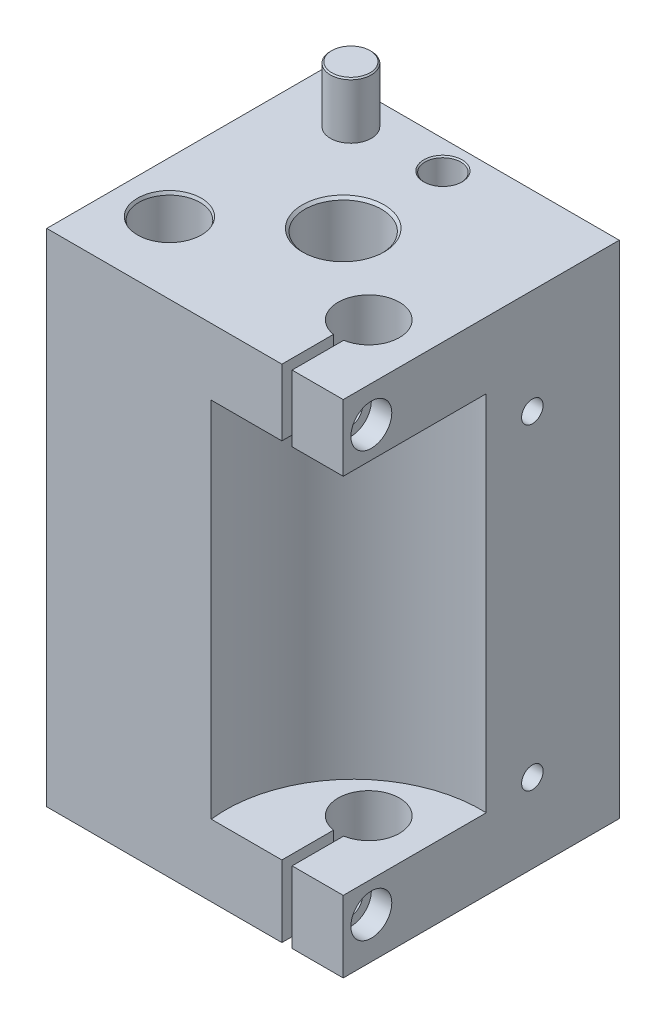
ISO-10303-21;
HEADER;
FILE_DESCRIPTION(('STEP AP214'),'2;1');
FILE_NAME('part.step','',(''),(''),'','','');
FILE_SCHEMA(('AUTOMOTIVE_DESIGN { 1 0 10303 214 1 1 1 1 }'));
ENDSEC;
DATA;
#1=APPLICATION_CONTEXT('core data for automotive mechanical design processes');
#2=APPLICATION_PROTOCOL_DEFINITION('international standard','automotive_design',2000,#1);
#3=PRODUCT_CONTEXT('',#1,'mechanical');
#4=PRODUCT('Part','Part','',(#3));
#5=PRODUCT_RELATED_PRODUCT_CATEGORY('part','',(#4));
#6=PRODUCT_DEFINITION_FORMATION('','',#4);
#7=PRODUCT_DEFINITION_CONTEXT('part definition',#1,'design');
#8=PRODUCT_DEFINITION('design','',#6,#7);
#9=PRODUCT_DEFINITION_SHAPE('','',#8);
#10=(LENGTH_UNIT() NAMED_UNIT(*) SI_UNIT(.MILLI.,.METRE.));
#11=(NAMED_UNIT(*) PLANE_ANGLE_UNIT() SI_UNIT($,.RADIAN.));
#12=(NAMED_UNIT(*) SI_UNIT($,.STERADIAN.) SOLID_ANGLE_UNIT());
#13=UNCERTAINTY_MEASURE_WITH_UNIT(LENGTH_MEASURE(1.E-05),#10,'distance_accuracy_value','');
#14=(GEOMETRIC_REPRESENTATION_CONTEXT(3) GLOBAL_UNCERTAINTY_ASSIGNED_CONTEXT((#13)) GLOBAL_UNIT_ASSIGNED_CONTEXT((#10,
#11,#12)) REPRESENTATION_CONTEXT('',''));
#15=CARTESIAN_POINT('',(0.,0.,0.));
#16=DIRECTION('',(0.,0.,1.));
#17=DIRECTION('',(1.,0.,0.));
#18=AXIS2_PLACEMENT_3D('',#15,#16,#17);
#19=CARTESIAN_POINT('',(58.,98.,0.));
#20=DIRECTION('',(-1.,0.,0.));
#21=DIRECTION('',(0.,0.,1.));
#22=AXIS2_PLACEMENT_3D('',#19,#20,#21);
#23=PLANE('',#22);
#24=CARTESIAN_POINT('',(58.,91.,-5.5));
#25=DIRECTION('',(1.,0.,0.));
#26=DIRECTION('',(0.,0.,-1.));
#27=AXIS2_PLACEMENT_3D('',#24,#25,#26);
#28=CIRCLE('',#27,4.);
#29=CARTESIAN_POINT('',(58.,91.,-9.5));
#30=VERTEX_POINT('',#29);
#31=EDGE_CURVE('E9358',#30,#30,#28,.T.);
#32=ORIENTED_EDGE('',*,*,#31,.F.);
#33=EDGE_LOOP('',(#32));
#34=FACE_BOUND('',#33,.T.);
#35=CARTESIAN_POINT('',(58.,15.5,-37.));
#36=DIRECTION('',(1.,0.,0.));
#37=DIRECTION('',(0.,0.,-1.));
#38=AXIS2_PLACEMENT_3D('',#35,#36,#37);
#39=CIRCLE('',#38,2.09999999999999);
#40=CARTESIAN_POINT('',(58.,15.5,-39.1));
#41=VERTEX_POINT('',#40);
#42=EDGE_CURVE('E9367',#41,#41,#39,.T.);
#43=ORIENTED_EDGE('',*,*,#42,.F.);
#44=EDGE_LOOP('',(#43));
#45=FACE_BOUND('',#44,.T.);
#46=CARTESIAN_POINT('',(58.,77.5,-37.));
#47=DIRECTION('',(1.,0.,0.));
#48=DIRECTION('',(0.,0.,-1.));
#49=AXIS2_PLACEMENT_3D('',#46,#47,#48);
#50=CIRCLE('',#49,2.1);
#51=CARTESIAN_POINT('',(58.,77.5,-39.1));
#52=VERTEX_POINT('',#51);
#53=EDGE_CURVE('E9373',#52,#52,#50,.T.);
#54=ORIENTED_EDGE('',*,*,#53,.F.);
#55=EDGE_LOOP('',(#54));
#56=FACE_BOUND('',#55,.T.);
#57=DIRECTION('',(0.,0.,1.));
#58=VECTOR('',#57,1.);
#59=CARTESIAN_POINT('',(58.,85.,0.));
#60=LINE('',#59,#58);
#61=CARTESIAN_POINT('',(58.,85.,-27.9799919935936));
#62=VERTEX_POINT('',#61);
#63=CARTESIAN_POINT('',(58.,85.,0.));
#64=VERTEX_POINT('',#63);
#65=EDGE_CURVE('E9455',#62,#64,#60,.T.);
#66=ORIENTED_EDGE('',*,*,#65,.F.);
#67=DIRECTION('',(0.,-1.,0.));
#68=VECTOR('',#67,1.);
#69=CARTESIAN_POINT('',(58.,85.,-27.9799919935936));
#70=LINE('',#69,#68);
#71=CARTESIAN_POINT('',(58.,14.,-27.9799919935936));
#72=VERTEX_POINT('',#71);
#73=EDGE_CURVE('E11',#62,#72,#70,.T.);
#74=ORIENTED_EDGE('',*,*,#73,.T.);
#75=DIRECTION('',(0.,0.,1.));
#76=VECTOR('',#75,1.);
#77=CARTESIAN_POINT('',(58.,14.,0.));
#78=LINE('',#77,#76);
#79=CARTESIAN_POINT('',(58.,14.,0.));
#80=VERTEX_POINT('',#79);
#81=EDGE_CURVE('E9443',#72,#80,#78,.T.);
#82=ORIENTED_EDGE('',*,*,#81,.T.);
#83=DIRECTION('',(0.,-1.,0.));
#84=VECTOR('',#83,1.);
#85=CARTESIAN_POINT('',(58.,98.,0.));
#86=LINE('',#85,#84);
#87=CARTESIAN_POINT('',(58.,0.,0.));
#88=VERTEX_POINT('',#87);
#89=EDGE_CURVE('E9550',#80,#88,#86,.T.);
#90=ORIENTED_EDGE('',*,*,#89,.T.);
#91=DIRECTION('',(0.,0.,-1.));
#92=VECTOR('',#91,1.);
#93=CARTESIAN_POINT('',(58.,0.,0.));
#94=LINE('',#93,#92);
#95=CARTESIAN_POINT('',(58.,0.,-54.));
#96=VERTEX_POINT('',#95);
#97=EDGE_CURVE('E9529',#88,#96,#94,.T.);
#98=ORIENTED_EDGE('',*,*,#97,.T.);
#99=DIRECTION('',(0.,-1.,0.));
#100=VECTOR('',#99,1.);
#101=CARTESIAN_POINT('',(58.,98.,-54.));
#102=LINE('',#101,#100);
#103=CARTESIAN_POINT('',(58.,98.,-54.));
#104=VERTEX_POINT('',#103);
#105=EDGE_CURVE('E9547',#104,#96,#102,.T.);
#106=ORIENTED_EDGE('',*,*,#105,.F.);
#107=DIRECTION('',(0.,0.,-1.));
#108=VECTOR('',#107,1.);
#109=CARTESIAN_POINT('',(58.,98.,0.));
#110=LINE('',#109,#108);
#111=CARTESIAN_POINT('',(58.,98.,0.));
#112=VERTEX_POINT('',#111);
#113=EDGE_CURVE('E9540',#112,#104,#110,.T.);
#114=ORIENTED_EDGE('',*,*,#113,.F.);
#115=EDGE_CURVE('E9551',#112,#64,#86,.T.);
#116=ORIENTED_EDGE('',*,*,#115,.T.);
#117=EDGE_LOOP('',(#66,#74,#82,#90,#98,#106,#114,#116));
#118=FACE_BOUND('',#117,.T.);
#119=CARTESIAN_POINT('',(58.,8.,-5.5));
#120=DIRECTION('',(1.,0.,0.));
#121=DIRECTION('',(0.,0.,-1.));
#122=AXIS2_PLACEMENT_3D('',#119,#120,#121);
#123=CIRCLE('',#122,3.99999999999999);
#124=CARTESIAN_POINT('',(58.,8.,-9.49999999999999));
#125=VERTEX_POINT('',#124);
#126=EDGE_CURVE('E9346',#125,#125,#123,.T.);
#127=ORIENTED_EDGE('',*,*,#126,.F.);
#128=EDGE_LOOP('',(#127));
#129=FACE_BOUND('',#128,.T.);
#130=ADVANCED_FACE('F9177',(#34,#45,#56,#118,#129),#23,.F.);
#131=CARTESIAN_POINT('',(0.,98.,0.));
#132=DIRECTION('',(0.,0.,-1.));
#133=DIRECTION('',(-1.,0.,0.));
#134=AXIS2_PLACEMENT_3D('',#131,#132,#133);
#135=PLANE('',#134);
#136=DIRECTION('',(-1.,0.,0.));
#137=VECTOR('',#136,1.);
#138=CARTESIAN_POINT('',(0.,85.,0.));
#139=LINE('',#138,#137);
#140=CARTESIAN_POINT('',(48.,85.,0.));
#141=VERTEX_POINT('',#140);
#142=EDGE_CURVE('E9451',#64,#141,#139,.T.);
#143=ORIENTED_EDGE('',*,*,#142,.F.);
#144=ORIENTED_EDGE('',*,*,#115,.F.);
#145=DIRECTION('',(1.,0.,0.));
#146=VECTOR('',#145,1.);
#147=CARTESIAN_POINT('',(0.,98.,0.));
#148=LINE('',#147,#146);
#149=CARTESIAN_POINT('',(48.,98.,0.));
#150=VERTEX_POINT('',#149);
#151=EDGE_CURVE('E9536',#150,#112,#148,.T.);
#152=ORIENTED_EDGE('',*,*,#151,.F.);
#153=DIRECTION('',(0.,1.,0.));
#154=VECTOR('',#153,1.);
#155=CARTESIAN_POINT('',(48.,100.,0.));
#156=LINE('',#155,#154);
#157=EDGE_CURVE('E9462',#141,#150,#156,.T.);
#158=ORIENTED_EDGE('',*,*,#157,.F.);
#159=EDGE_LOOP('',(#143,#144,#152,#158));
#160=FACE_BOUND('',#159,.T.);
#161=ADVANCED_FACE('F9605',(#160),#135,.F.);
#162=DIRECTION('',(-1.,0.,0.));
#163=VECTOR('',#162,1.);
#164=CARTESIAN_POINT('',(0.,85.,0.));
#165=LINE('',#164,#163);
#166=CARTESIAN_POINT('',(46.,85.,0.));
#167=VERTEX_POINT('',#166);
#168=CARTESIAN_POINT('',(32.1806527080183,85.,0.));
#169=VERTEX_POINT('',#168);
#170=EDGE_CURVE('E9457',#167,#169,#165,.T.);
#171=ORIENTED_EDGE('',*,*,#170,.F.);
#172=DIRECTION('',(0.,-1.,0.));
#173=VECTOR('',#172,1.);
#174=CARTESIAN_POINT('',(46.,100.,0.));
#175=LINE('',#174,#173);
#176=CARTESIAN_POINT('',(46.,98.,0.));
#177=VERTEX_POINT('',#176);
#178=EDGE_CURVE('E9467',#177,#167,#175,.T.);
#179=ORIENTED_EDGE('',*,*,#178,.F.);
#180=CARTESIAN_POINT('',(0.,98.,0.));
#181=VERTEX_POINT('',#180);
#182=EDGE_CURVE('E9537',#181,#177,#148,.T.);
#183=ORIENTED_EDGE('',*,*,#182,.F.);
#184=DIRECTION('',(0.,-1.,0.));
#185=VECTOR('',#184,1.);
#186=CARTESIAN_POINT('',(0.,98.,0.));
#187=LINE('',#186,#185);
#188=CARTESIAN_POINT('',(0.,0.,0.));
#189=VERTEX_POINT('',#188);
#190=EDGE_CURVE('E9554',#181,#189,#187,.T.);
#191=ORIENTED_EDGE('',*,*,#190,.T.);
#192=DIRECTION('',(1.,0.,0.));
#193=VECTOR('',#192,1.);
#194=CARTESIAN_POINT('',(0.,0.,0.));
#195=LINE('',#194,#193);
#196=CARTESIAN_POINT('',(46.,0.,0.));
#197=VERTEX_POINT('',#196);
#198=EDGE_CURVE('E9526',#189,#197,#195,.T.);
#199=ORIENTED_EDGE('',*,*,#198,.T.);
#200=CARTESIAN_POINT('',(46.,14.,0.));
#201=VERTEX_POINT('',#200);
#202=EDGE_CURVE('E9466',#201,#197,#175,.T.);
#203=ORIENTED_EDGE('',*,*,#202,.F.);
#204=DIRECTION('',(-1.,0.,0.));
#205=VECTOR('',#204,1.);
#206=CARTESIAN_POINT('',(0.,14.,0.));
#207=LINE('',#206,#205);
#208=CARTESIAN_POINT('',(32.1806527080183,14.,0.));
#209=VERTEX_POINT('',#208);
#210=EDGE_CURVE('E9446',#201,#209,#207,.T.);
#211=ORIENTED_EDGE('',*,*,#210,.T.);
#212=DIRECTION('',(0.,-1.,0.));
#213=VECTOR('',#212,1.);
#214=CARTESIAN_POINT('',(32.1806527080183,85.,0.));
#215=LINE('',#214,#213);
#216=EDGE_CURVE('E9459',#209,#169,#215,.F.);
#217=ORIENTED_EDGE('',*,*,#216,.T.);
#218=EDGE_LOOP('',(#171,#179,#183,#191,#199,#203,#211,#217));
#219=FACE_BOUND('',#218,.T.);
#220=ADVANCED_FACE('F9593',(#219),#135,.F.);
#221=CARTESIAN_POINT('',(47.,98.,-16.));
#222=DIRECTION('',(0.,1.,0.));
#223=DIRECTION('',(0.,0.,1.));
#224=AXIS2_PLACEMENT_3D('',#221,#222,#223);
#225=CYLINDRICAL_SURFACE('',#224,5.99999999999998);
#226=CARTESIAN_POINT('',(47.,85.,-16.));
#227=DIRECTION('',(0.,-1.,0.));
#228=DIRECTION('',(0.,0.,-1.));
#229=AXIS2_PLACEMENT_3D('',#226,#227,#228);
#230=CIRCLE('',#229,5.99999999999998);
#231=CARTESIAN_POINT('',(48.,85.,-10.0839202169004));
#232=VERTEX_POINT('',#231);
#233=CARTESIAN_POINT('',(46.,85.,-10.0839202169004));
#234=VERTEX_POINT('',#233);
#235=EDGE_CURVE('E9449',#232,#234,#230,.F.);
#236=ORIENTED_EDGE('',*,*,#235,.F.);
#237=DIRECTION('',(0.,1.,0.));
#238=VECTOR('',#237,1.);
#239=CARTESIAN_POINT('',(48.,98.,-10.0839202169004));
#240=LINE('',#239,#238);
#241=CARTESIAN_POINT('',(48.,98.,-10.0839202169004));
#242=VERTEX_POINT('',#241);
#243=EDGE_CURVE('E9200',#232,#242,#240,.T.);
#244=ORIENTED_EDGE('',*,*,#243,.T.);
#245=CARTESIAN_POINT('',(47.,98.,-16.));
#246=DIRECTION('',(0.,1.,0.));
#247=DIRECTION('',(0.,0.,1.));
#248=AXIS2_PLACEMENT_3D('',#245,#246,#247);
#249=CIRCLE('',#248,5.99999999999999);
#250=CARTESIAN_POINT('',(46.,98.,-10.0839202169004));
#251=VERTEX_POINT('',#250);
#252=EDGE_CURVE('E9484',#242,#251,#249,.T.);
#253=ORIENTED_EDGE('',*,*,#252,.T.);
#254=DIRECTION('',(0.,1.,0.));
#255=VECTOR('',#254,1.);
#256=CARTESIAN_POINT('',(46.,98.,-10.0839202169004));
#257=LINE('',#256,#255);
#258=EDGE_CURVE('E9567',#251,#234,#257,.F.);
#259=ORIENTED_EDGE('',*,*,#258,.T.);
#260=EDGE_LOOP('',(#236,#244,#253,#259));
#261=FACE_BOUND('',#260,.T.);
#262=ADVANCED_FACE('F9581',(#261),#225,.F.);
#263=CARTESIAN_POINT('',(46.,100.,-16.));
#264=DIRECTION('',(-1.,0.,0.));
#265=DIRECTION('',(0.,-1.,0.));
#266=AXIS2_PLACEMENT_3D('',#263,#264,#265);
#267=PLANE('',#266);
#268=CARTESIAN_POINT('',(46.,91.,-5.5));
#269=DIRECTION('',(1.,0.,0.));
#270=DIRECTION('',(0.,0.,-1.));
#271=AXIS2_PLACEMENT_3D('',#268,#269,#270);
#272=CIRCLE('',#271,1.64999999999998);
#273=CARTESIAN_POINT('',(46.,91.,-7.14999999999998));
#274=VERTEX_POINT('',#273);
#275=EDGE_CURVE('E9332',#274,#274,#272,.T.);
#276=ORIENTED_EDGE('',*,*,#275,.F.);
#277=EDGE_LOOP('',(#276));
#278=FACE_BOUND('',#277,.T.);
#279=DIRECTION('',(0.,0.,1.));
#280=VECTOR('',#279,1.);
#281=CARTESIAN_POINT('',(46.,85.,-16.));
#282=LINE('',#281,#280);
#283=EDGE_CURVE('E9453',#234,#167,#282,.T.);
#284=ORIENTED_EDGE('',*,*,#283,.F.);
#285=ORIENTED_EDGE('',*,*,#258,.F.);
#286=DIRECTION('',(0.,0.,-1.));
#287=VECTOR('',#286,1.);
#288=CARTESIAN_POINT('',(46.,98.,-54.));
#289=LINE('',#288,#287);
#290=EDGE_CURVE('E9470',#177,#251,#289,.T.);
#291=ORIENTED_EDGE('',*,*,#290,.F.);
#292=ORIENTED_EDGE('',*,*,#178,.T.);
#293=EDGE_LOOP('',(#284,#285,#291,#292));
#294=FACE_BOUND('',#293,.T.);
#295=ADVANCED_FACE('F9590',(#278,#294),#267,.F.);
#296=CARTESIAN_POINT('',(48.,100.,-16.));
#297=DIRECTION('',(1.,0.,0.));
#298=DIRECTION('',(0.,1.,0.));
#299=AXIS2_PLACEMENT_3D('',#296,#297,#298);
#300=PLANE('',#299);
#301=CARTESIAN_POINT('',(48.,91.,-5.5));
#302=DIRECTION('',(1.,0.,0.));
#303=DIRECTION('',(0.,1.,0.));
#304=AXIS2_PLACEMENT_3D('',#301,#302,#303);
#305=CIRCLE('',#304,2.25);
#306=CARTESIAN_POINT('',(48.,93.25,-5.5));
#307=VERTEX_POINT('',#306);
#308=EDGE_CURVE('E9361',#307,#307,#305,.T.);
#309=ORIENTED_EDGE('',*,*,#308,.T.);
#310=EDGE_LOOP('',(#309));
#311=FACE_BOUND('',#310,.T.);
#312=DIRECTION('',(0.,0.,-1.));
#313=VECTOR('',#312,1.);
#314=CARTESIAN_POINT('',(48.,85.,-16.));
#315=LINE('',#314,#313);
#316=EDGE_CURVE('E9185',#141,#232,#315,.T.);
#317=ORIENTED_EDGE('',*,*,#316,.F.);
#318=ORIENTED_EDGE('',*,*,#157,.T.);
#319=DIRECTION('',(0.,0.,1.));
#320=VECTOR('',#319,1.);
#321=CARTESIAN_POINT('',(48.,98.,-54.));
#322=LINE('',#321,#320);
#323=EDGE_CURVE('E9476',#242,#150,#322,.T.);
#324=ORIENTED_EDGE('',*,*,#323,.F.);
#325=ORIENTED_EDGE('',*,*,#243,.F.);
#326=EDGE_LOOP('',(#317,#318,#324,#325));
#327=FACE_BOUND('',#326,.T.);
#328=ADVANCED_FACE('F9582',(#311,#327),#300,.F.);
#329=ORIENTED_EDGE('',*,*,#89,.F.);
#330=DIRECTION('',(-1.,0.,0.));
#331=VECTOR('',#330,1.);
#332=CARTESIAN_POINT('',(0.,14.,0.));
#333=LINE('',#332,#331);
#334=CARTESIAN_POINT('',(48.,14.,0.));
#335=VERTEX_POINT('',#334);
#336=EDGE_CURVE('E9437',#80,#335,#333,.T.);
#337=ORIENTED_EDGE('',*,*,#336,.T.);
#338=CARTESIAN_POINT('',(48.,0.,0.));
#339=VERTEX_POINT('',#338);
#340=EDGE_CURVE('E9463',#339,#335,#156,.T.);
#341=ORIENTED_EDGE('',*,*,#340,.F.);
#342=EDGE_CURVE('E9525',#339,#88,#195,.T.);
#343=ORIENTED_EDGE('',*,*,#342,.T.);
#344=EDGE_LOOP('',(#329,#337,#341,#343));
#345=FACE_BOUND('',#344,.T.);
#346=ADVANCED_FACE('F9636',(#345),#135,.F.);
#347=CARTESIAN_POINT('',(0.,0.,-54.));
#348=DIRECTION('',(0.,-1.,0.));
#349=DIRECTION('',(0.,0.,-1.));
#350=AXIS2_PLACEMENT_3D('',#347,#348,#349);
#351=PLANE('',#350);
#352=DIRECTION('',(0.,0.,1.));
#353=VECTOR('',#352,1.);
#354=CARTESIAN_POINT('',(48.,0.,-54.));
#355=LINE('',#354,#353);
#356=CARTESIAN_POINT('',(48.,0.,-10.0839202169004));
#357=VERTEX_POINT('',#356);
#358=EDGE_CURVE('E9479',#357,#339,#355,.T.);
#359=ORIENTED_EDGE('',*,*,#358,.F.);
#360=CARTESIAN_POINT('',(47.,0.,-16.));
#361=DIRECTION('',(0.,1.,0.));
#362=DIRECTION('',(0.,0.,1.));
#363=AXIS2_PLACEMENT_3D('',#360,#361,#362);
#364=CIRCLE('',#363,5.99999999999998);
#365=CARTESIAN_POINT('',(46.,0.,-10.0839202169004));
#366=VERTEX_POINT('',#365);
#367=EDGE_CURVE('E9481',#357,#366,#364,.T.);
#368=ORIENTED_EDGE('',*,*,#367,.T.);
#369=DIRECTION('',(0.,0.,-1.));
#370=VECTOR('',#369,1.);
#371=CARTESIAN_POINT('',(46.,0.,-54.));
#372=LINE('',#371,#370);
#373=EDGE_CURVE('E9473',#197,#366,#372,.T.);
#374=ORIENTED_EDGE('',*,*,#373,.F.);
#375=ORIENTED_EDGE('',*,*,#198,.F.);
#376=DIRECTION('',(0.,0.,1.));
#377=VECTOR('',#376,1.);
#378=CARTESIAN_POINT('',(0.,0.,0.));
#379=LINE('',#378,#377);
#380=CARTESIAN_POINT('',(0.,0.,-54.));
#381=VERTEX_POINT('',#380);
#382=EDGE_CURVE('E9522',#381,#189,#379,.T.);
#383=ORIENTED_EDGE('',*,*,#382,.F.);
#384=DIRECTION('',(-1.,0.,0.));
#385=VECTOR('',#384,1.);
#386=CARTESIAN_POINT('',(0.,0.,-54.));
#387=LINE('',#386,#385);
#388=EDGE_CURVE('E9531',#96,#381,#387,.T.);
#389=ORIENTED_EDGE('',*,*,#388,.F.);
#390=ORIENTED_EDGE('',*,*,#97,.F.);
#391=ORIENTED_EDGE('',*,*,#342,.F.);
#392=EDGE_LOOP('',(#359,#368,#374,#375,#383,#389,#390,#391));
#393=FACE_BOUND('',#392,.T.);
#394=CARTESIAN_POINT('',(29.,0.,-48.5));
#395=DIRECTION('',(0.,1.,0.));
#396=DIRECTION('',(0.,0.,1.));
#397=AXIS2_PLACEMENT_3D('',#394,#395,#396);
#398=CIRCLE('',#397,3.74999999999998);
#399=CARTESIAN_POINT('',(29.,0.,-44.75));
#400=VERTEX_POINT('',#399);
#401=EDGE_CURVE('E9486',#400,#400,#398,.T.);
#402=ORIENTED_EDGE('',*,*,#401,.T.);
#403=EDGE_LOOP('',(#402));
#404=FACE_BOUND('',#403,.T.);
#405=CARTESIAN_POINT('',(29.,0.,-29.));
#406=DIRECTION('',(0.,1.,0.));
#407=DIRECTION('',(0.,0.,1.));
#408=AXIS2_PLACEMENT_3D('',#405,#406,#407);
#409=CIRCLE('',#408,7.99999999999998);
#410=CARTESIAN_POINT('',(29.,0.,-21.));
#411=VERTEX_POINT('',#410);
#412=EDGE_CURVE('E9510',#411,#411,#409,.T.);
#413=ORIENTED_EDGE('',*,*,#412,.T.);
#414=EDGE_LOOP('',(#413));
#415=FACE_BOUND('',#414,.T.);
#416=CARTESIAN_POINT('',(10.,0.,-14.));
#417=DIRECTION('',(0.,1.,0.));
#418=DIRECTION('',(0.,0.,1.));
#419=AXIS2_PLACEMENT_3D('',#416,#417,#418);
#420=CIRCLE('',#419,6.24999999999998);
#421=CARTESIAN_POINT('',(10.,0.,-7.75000000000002));
#422=VERTEX_POINT('',#421);
#423=EDGE_CURVE('E9498',#422,#422,#420,.T.);
#424=ORIENTED_EDGE('',*,*,#423,.T.);
#425=EDGE_LOOP('',(#424));
#426=FACE_BOUND('',#425,.T.);
#427=ADVANCED_FACE('F9621',(#393,#404,#415,#426),#351,.T.);
#428=CARTESIAN_POINT('',(0.,98.,-54.));
#429=DIRECTION('',(0.,-1.,0.));
#430=DIRECTION('',(0.,0.,-1.));
#431=AXIS2_PLACEMENT_3D('',#428,#429,#430);
#432=PLANE('',#431);
#433=ORIENTED_EDGE('',*,*,#252,.F.);
#434=ORIENTED_EDGE('',*,*,#323,.T.);
#435=ORIENTED_EDGE('',*,*,#151,.T.);
#436=ORIENTED_EDGE('',*,*,#113,.T.);
#437=DIRECTION('',(-1.,0.,0.));
#438=VECTOR('',#437,1.);
#439=CARTESIAN_POINT('',(0.,98.,-54.));
#440=LINE('',#439,#438);
#441=CARTESIAN_POINT('',(0.,98.,-54.));
#442=VERTEX_POINT('',#441);
#443=EDGE_CURVE('E9542',#104,#442,#440,.T.);
#444=ORIENTED_EDGE('',*,*,#443,.T.);
#445=DIRECTION('',(0.,0.,1.));
#446=VECTOR('',#445,1.);
#447=CARTESIAN_POINT('',(0.,98.,0.));
#448=LINE('',#447,#446);
#449=EDGE_CURVE('E9533',#442,#181,#448,.T.);
#450=ORIENTED_EDGE('',*,*,#449,.T.);
#451=ORIENTED_EDGE('',*,*,#182,.T.);
#452=ORIENTED_EDGE('',*,*,#290,.T.);
#453=EDGE_LOOP('',(#433,#434,#435,#436,#444,#450,#451,#452));
#454=FACE_BOUND('',#453,.T.);
#455=CARTESIAN_POINT('',(29.,98.,-29.));
#456=DIRECTION('',(0.,1.,0.));
#457=DIRECTION('',(0.,0.,1.));
#458=AXIS2_PLACEMENT_3D('',#455,#456,#457);
#459=CIRCLE('',#458,8.);
#460=CARTESIAN_POINT('',(29.,98.,-21.));
#461=VERTEX_POINT('',#460);
#462=EDGE_CURVE('E9519',#461,#461,#459,.T.);
#463=ORIENTED_EDGE('',*,*,#462,.F.);
#464=EDGE_LOOP('',(#463));
#465=FACE_BOUND('',#464,.T.);
#466=CARTESIAN_POINT('',(10.,98.,-14.));
#467=DIRECTION('',(0.,1.,0.));
#468=DIRECTION('',(0.,0.,1.));
#469=AXIS2_PLACEMENT_3D('',#466,#467,#468);
#470=CIRCLE('',#469,6.25);
#471=CARTESIAN_POINT('',(10.,98.,-7.75));
#472=VERTEX_POINT('',#471);
#473=EDGE_CURVE('E9507',#472,#472,#470,.T.);
#474=ORIENTED_EDGE('',*,*,#473,.F.);
#475=EDGE_LOOP('',(#474));
#476=FACE_BOUND('',#475,.T.);
#477=CARTESIAN_POINT('',(29.,98.,-48.5));
#478=DIRECTION('',(0.,1.,0.));
#479=DIRECTION('',(0.,0.,1.));
#480=AXIS2_PLACEMENT_3D('',#477,#478,#479);
#481=CIRCLE('',#480,3.75);
#482=CARTESIAN_POINT('',(29.,98.,-44.75));
#483=VERTEX_POINT('',#482);
#484=EDGE_CURVE('E9495',#483,#483,#481,.T.);
#485=ORIENTED_EDGE('',*,*,#484,.F.);
#486=EDGE_LOOP('',(#485));
#487=FACE_BOUND('',#486,.T.);
#488=CARTESIAN_POINT('',(12.5,98.,-47.));
#489=DIRECTION('',(0.,-1.,0.));
#490=DIRECTION('',(0.,0.,-1.));
#491=AXIS2_PLACEMENT_3D('',#488,#489,#490);
#492=CIRCLE('',#491,4.);
#493=CARTESIAN_POINT('',(12.5,98.,-51.));
#494=VERTEX_POINT('',#493);
#495=EDGE_CURVE('E9557',#494,#494,#492,.F.);
#496=ORIENTED_EDGE('',*,*,#495,.F.);
#497=EDGE_LOOP('',(#496));
#498=FACE_BOUND('',#497,.T.);
#499=ADVANCED_FACE('F9586',(#454,#465,#476,#487,#498),#432,.F.);
#500=CARTESIAN_POINT('',(0.,98.,0.));
#501=DIRECTION('',(1.,0.,0.));
#502=DIRECTION('',(0.,0.,-1.));
#503=AXIS2_PLACEMENT_3D('',#500,#501,#502);
#504=PLANE('',#503);
#505=CARTESIAN_POINT('',(0.,15.5,-37.));
#506=DIRECTION('',(-1.,0.,0.));
#507=DIRECTION('',(0.,0.,1.));
#508=AXIS2_PLACEMENT_3D('',#505,#506,#507);
#509=CIRCLE('',#508,2.09999999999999);
#510=CARTESIAN_POINT('',(0.,15.5,-34.9));
#511=VERTEX_POINT('',#510);
#512=EDGE_CURVE('E9421',#511,#511,#509,.T.);
#513=ORIENTED_EDGE('',*,*,#512,.F.);
#514=EDGE_LOOP('',(#513));
#515=FACE_BOUND('',#514,.T.);
#516=CARTESIAN_POINT('',(0.,77.5,-37.));
#517=DIRECTION('',(-1.,0.,0.));
#518=DIRECTION('',(0.,0.,1.));
#519=AXIS2_PLACEMENT_3D('',#516,#517,#518);
#520=CIRCLE('',#519,2.09999999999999);
#521=CARTESIAN_POINT('',(0.,77.5,-34.9));
#522=VERTEX_POINT('',#521);
#523=EDGE_CURVE('E9427',#522,#522,#520,.T.);
#524=ORIENTED_EDGE('',*,*,#523,.F.);
#525=EDGE_LOOP('',(#524));
#526=FACE_BOUND('',#525,.T.);
#527=ORIENTED_EDGE('',*,*,#382,.T.);
#528=ORIENTED_EDGE('',*,*,#190,.F.);
#529=ORIENTED_EDGE('',*,*,#449,.F.);
#530=DIRECTION('',(0.,-1.,0.));
#531=VECTOR('',#530,1.);
#532=CARTESIAN_POINT('',(0.,98.,-54.));
#533=LINE('',#532,#531);
#534=EDGE_CURVE('E9544',#442,#381,#533,.T.);
#535=ORIENTED_EDGE('',*,*,#534,.T.);
#536=EDGE_LOOP('',(#527,#528,#529,#535));
#537=FACE_BOUND('',#536,.T.);
#538=ADVANCED_FACE('F9179',(#515,#526,#537),#504,.F.);
#539=CARTESIAN_POINT('',(0.,98.,-54.));
#540=DIRECTION('',(0.,0.,1.));
#541=DIRECTION('',(1.,0.,0.));
#542=AXIS2_PLACEMENT_3D('',#539,#540,#541);
#543=PLANE('',#542);
#544=CARTESIAN_POINT('',(52.,76.,-54.));
#545=DIRECTION('',(0.,0.,-1.));
#546=DIRECTION('',(-1.,0.,0.));
#547=AXIS2_PLACEMENT_3D('',#544,#545,#546);
#548=CIRCLE('',#547,2.625);
#549=CARTESIAN_POINT('',(49.375,76.,-54.));
#550=VERTEX_POINT('',#549);
#551=EDGE_CURVE('E9382',#550,#550,#548,.T.);
#552=ORIENTED_EDGE('',*,*,#551,.F.);
#553=EDGE_LOOP('',(#552));
#554=FACE_BOUND('',#553,.T.);
#555=CARTESIAN_POINT('',(6.,76.,-54.));
#556=DIRECTION('',(0.,0.,-1.));
#557=DIRECTION('',(-1.,0.,0.));
#558=AXIS2_PLACEMENT_3D('',#555,#556,#557);
#559=CIRCLE('',#558,2.625);
#560=CARTESIAN_POINT('',(3.375,76.,-54.));
#561=VERTEX_POINT('',#560);
#562=EDGE_CURVE('E9391',#561,#561,#559,.T.);
#563=ORIENTED_EDGE('',*,*,#562,.F.);
#564=EDGE_LOOP('',(#563));
#565=FACE_BOUND('',#564,.T.);
#566=CARTESIAN_POINT('',(52.,61.,-54.));
#567=DIRECTION('',(0.,0.,-1.));
#568=DIRECTION('',(-1.,0.,0.));
#569=AXIS2_PLACEMENT_3D('',#566,#567,#568);
#570=CIRCLE('',#569,2.5);
#571=CARTESIAN_POINT('',(49.5,61.,-54.));
#572=VERTEX_POINT('',#571);
#573=EDGE_CURVE('E9397',#572,#572,#570,.T.);
#574=ORIENTED_EDGE('',*,*,#573,.F.);
#575=EDGE_LOOP('',(#574));
#576=FACE_BOUND('',#575,.T.);
#577=CARTESIAN_POINT('',(52.,91.,-54.));
#578=DIRECTION('',(0.,0.,-1.));
#579=DIRECTION('',(-1.,0.,0.));
#580=AXIS2_PLACEMENT_3D('',#577,#578,#579);
#581=CIRCLE('',#580,2.5);
#582=CARTESIAN_POINT('',(49.5,91.,-54.));
#583=VERTEX_POINT('',#582);
#584=EDGE_CURVE('E9403',#583,#583,#581,.T.);
#585=ORIENTED_EDGE('',*,*,#584,.F.);
#586=EDGE_LOOP('',(#585));
#587=FACE_BOUND('',#586,.T.);
#588=CARTESIAN_POINT('',(6.,61.,-54.));
#589=DIRECTION('',(0.,0.,-1.));
#590=DIRECTION('',(-1.,0.,0.));
#591=AXIS2_PLACEMENT_3D('',#588,#589,#590);
#592=CIRCLE('',#591,2.5);
#593=CARTESIAN_POINT('',(3.5,61.,-54.));
#594=VERTEX_POINT('',#593);
#595=EDGE_CURVE('E9409',#594,#594,#592,.T.);
#596=ORIENTED_EDGE('',*,*,#595,.F.);
#597=EDGE_LOOP('',(#596));
#598=FACE_BOUND('',#597,.T.);
#599=CARTESIAN_POINT('',(6.,91.,-54.));
#600=DIRECTION('',(0.,0.,-1.));
#601=DIRECTION('',(-1.,0.,0.));
#602=AXIS2_PLACEMENT_3D('',#599,#600,#601);
#603=CIRCLE('',#602,2.5);
#604=CARTESIAN_POINT('',(3.5,91.,-54.));
#605=VERTEX_POINT('',#604);
#606=EDGE_CURVE('E9415',#605,#605,#603,.T.);
#607=ORIENTED_EDGE('',*,*,#606,.F.);
#608=EDGE_LOOP('',(#607));
#609=FACE_BOUND('',#608,.T.);
#610=ORIENTED_EDGE('',*,*,#388,.T.);
#611=ORIENTED_EDGE('',*,*,#534,.F.);
#612=ORIENTED_EDGE('',*,*,#443,.F.);
#613=ORIENTED_EDGE('',*,*,#105,.T.);
#614=EDGE_LOOP('',(#610,#611,#612,#613));
#615=FACE_BOUND('',#614,.T.);
#616=ADVANCED_FACE('F9612',(#554,#565,#576,#587,#598,#609,#615),#543,.F.);
#617=CARTESIAN_POINT('',(29.,98.,-29.));
#618=DIRECTION('',(0.,1.,0.));
#619=DIRECTION('',(0.,0.,1.));
#620=AXIS2_PLACEMENT_3D('',#617,#618,#619);
#621=CONICAL_SURFACE('',#620,8.,0.785398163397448);
#622=CARTESIAN_POINT('',(29.,97.5,-29.));
#623=DIRECTION('',(0.,1.,0.));
#624=DIRECTION('',(0.,0.,1.));
#625=AXIS2_PLACEMENT_3D('',#622,#623,#624);
#626=CIRCLE('',#625,7.49999999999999);
#627=CARTESIAN_POINT('',(29.,97.5,-21.5));
#628=VERTEX_POINT('',#627);
#629=EDGE_CURVE('E9516',#628,#628,#626,.T.);
#630=ORIENTED_EDGE('',*,*,#629,.F.);
#631=EDGE_LOOP('',(#630));
#632=FACE_BOUND('',#631,.T.);
#633=ORIENTED_EDGE('',*,*,#462,.T.);
#634=EDGE_LOOP('',(#633));
#635=FACE_BOUND('',#634,.T.);
#636=ADVANCED_FACE('F9661',(#632,#635),#621,.F.);
#637=CARTESIAN_POINT('',(29.,98.,-29.));
#638=DIRECTION('',(0.,1.,0.));
#639=DIRECTION('',(0.,0.,1.));
#640=AXIS2_PLACEMENT_3D('',#637,#638,#639);
#641=CYLINDRICAL_SURFACE('',#640,7.49999999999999);
#642=CARTESIAN_POINT('',(29.,0.5,-29.));
#643=DIRECTION('',(0.,1.,0.));
#644=DIRECTION('',(0.,0.,1.));
#645=AXIS2_PLACEMENT_3D('',#642,#643,#644);
#646=CIRCLE('',#645,7.49999999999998);
#647=CARTESIAN_POINT('',(29.,0.5,-21.5));
#648=VERTEX_POINT('',#647);
#649=EDGE_CURVE('E9513',#648,#648,#646,.T.);
#650=ORIENTED_EDGE('',*,*,#649,.F.);
#651=EDGE_LOOP('',(#650));
#652=FACE_BOUND('',#651,.T.);
#653=ORIENTED_EDGE('',*,*,#629,.T.);
#654=EDGE_LOOP('',(#653));
#655=FACE_BOUND('',#654,.T.);
#656=ADVANCED_FACE('F9667',(#652,#655),#641,.F.);
#657=CARTESIAN_POINT('',(29.,0.5,-29.));
#658=DIRECTION('',(0.,-1.,0.));
#659=DIRECTION('',(0.,0.,-1.));
#660=AXIS2_PLACEMENT_3D('',#657,#658,#659);
#661=CONICAL_SURFACE('',#660,7.49999999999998,0.785398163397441);
#662=ORIENTED_EDGE('',*,*,#412,.F.);
#663=EDGE_LOOP('',(#662));
#664=FACE_BOUND('',#663,.T.);
#665=ORIENTED_EDGE('',*,*,#649,.T.);
#666=EDGE_LOOP('',(#665));
#667=FACE_BOUND('',#666,.T.);
#668=ADVANCED_FACE('F9671',(#664,#667),#661,.F.);
#669=CARTESIAN_POINT('',(10.,98.,-14.));
#670=DIRECTION('',(0.,1.,0.));
#671=DIRECTION('',(0.,0.,1.));
#672=AXIS2_PLACEMENT_3D('',#669,#670,#671);
#673=CONICAL_SURFACE('',#672,6.25,0.392699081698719);
#674=CARTESIAN_POINT('',(10.,97.3964466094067,-14.));
#675=DIRECTION('',(0.,1.,0.));
#676=DIRECTION('',(0.,0.,1.));
#677=AXIS2_PLACEMENT_3D('',#674,#675,#676);
#678=CIRCLE('',#677,5.99999999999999);
#679=CARTESIAN_POINT('',(10.,97.3964466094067,-8.00000000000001));
#680=VERTEX_POINT('',#679);
#681=EDGE_CURVE('E9504',#680,#680,#678,.T.);
#682=ORIENTED_EDGE('',*,*,#681,.F.);
#683=EDGE_LOOP('',(#682));
#684=FACE_BOUND('',#683,.T.);
#685=ORIENTED_EDGE('',*,*,#473,.T.);
#686=EDGE_LOOP('',(#685));
#687=FACE_BOUND('',#686,.T.);
#688=ADVANCED_FACE('F9675',(#684,#687),#673,.F.);
#689=CARTESIAN_POINT('',(10.,98.,-14.));
#690=DIRECTION('',(0.,1.,0.));
#691=DIRECTION('',(0.,0.,1.));
#692=AXIS2_PLACEMENT_3D('',#689,#690,#691);
#693=CYLINDRICAL_SURFACE('',#692,5.99999999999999);
#694=CARTESIAN_POINT('',(10.,0.603553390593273,-14.));
#695=DIRECTION('',(0.,1.,0.));
#696=DIRECTION('',(0.,0.,1.));
#697=AXIS2_PLACEMENT_3D('',#694,#695,#696);
#698=CIRCLE('',#697,5.99999999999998);
#699=CARTESIAN_POINT('',(10.,0.603553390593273,-8.00000000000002));
#700=VERTEX_POINT('',#699);
#701=EDGE_CURVE('E9501',#700,#700,#698,.T.);
#702=ORIENTED_EDGE('',*,*,#701,.F.);
#703=EDGE_LOOP('',(#702));
#704=FACE_BOUND('',#703,.T.);
#705=ORIENTED_EDGE('',*,*,#681,.T.);
#706=EDGE_LOOP('',(#705));
#707=FACE_BOUND('',#706,.T.);
#708=ADVANCED_FACE('F9679',(#704,#707),#693,.F.);
#709=CARTESIAN_POINT('',(10.,0.603553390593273,-14.));
#710=DIRECTION('',(0.,-1.,0.));
#711=DIRECTION('',(0.,0.,-1.));
#712=AXIS2_PLACEMENT_3D('',#709,#710,#711);
#713=CONICAL_SURFACE('',#712,5.99999999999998,0.39269908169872);
#714=ORIENTED_EDGE('',*,*,#423,.F.);
#715=EDGE_LOOP('',(#714));
#716=FACE_BOUND('',#715,.T.);
#717=ORIENTED_EDGE('',*,*,#701,.T.);
#718=EDGE_LOOP('',(#717));
#719=FACE_BOUND('',#718,.T.);
#720=ADVANCED_FACE('F9683',(#716,#719),#713,.F.);
#721=CARTESIAN_POINT('',(29.,98.,-48.5));
#722=DIRECTION('',(0.,1.,0.));
#723=DIRECTION('',(0.,0.,1.));
#724=AXIS2_PLACEMENT_3D('',#721,#722,#723);
#725=CONICAL_SURFACE('',#724,3.75,0.785398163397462);
#726=CARTESIAN_POINT('',(29.,97.75,-48.5));
#727=DIRECTION('',(0.,1.,0.));
#728=DIRECTION('',(0.,0.,1.));
#729=AXIS2_PLACEMENT_3D('',#726,#727,#728);
#730=CIRCLE('',#729,3.49999999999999);
#731=CARTESIAN_POINT('',(29.,97.75,-45.));
#732=VERTEX_POINT('',#731);
#733=EDGE_CURVE('E9492',#732,#732,#730,.T.);
#734=ORIENTED_EDGE('',*,*,#733,.F.);
#735=EDGE_LOOP('',(#734));
#736=FACE_BOUND('',#735,.T.);
#737=ORIENTED_EDGE('',*,*,#484,.T.);
#738=EDGE_LOOP('',(#737));
#739=FACE_BOUND('',#738,.T.);
#740=ADVANCED_FACE('F9687',(#736,#739),#725,.F.);
#741=CARTESIAN_POINT('',(29.,98.,-48.5));
#742=DIRECTION('',(0.,1.,0.));
#743=DIRECTION('',(0.,0.,1.));
#744=AXIS2_PLACEMENT_3D('',#741,#742,#743);
#745=CYLINDRICAL_SURFACE('',#744,3.49999999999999);
#746=CARTESIAN_POINT('',(29.,0.25,-48.5));
#747=DIRECTION('',(0.,1.,0.));
#748=DIRECTION('',(0.,0.,1.));
#749=AXIS2_PLACEMENT_3D('',#746,#747,#748);
#750=CIRCLE('',#749,3.49999999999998);
#751=CARTESIAN_POINT('',(29.,0.25,-45.));
#752=VERTEX_POINT('',#751);
#753=EDGE_CURVE('E9489',#752,#752,#750,.T.);
#754=ORIENTED_EDGE('',*,*,#753,.F.);
#755=EDGE_LOOP('',(#754));
#756=FACE_BOUND('',#755,.T.);
#757=ORIENTED_EDGE('',*,*,#733,.T.);
#758=EDGE_LOOP('',(#757));
#759=FACE_BOUND('',#758,.T.);
#760=ADVANCED_FACE('F9691',(#756,#759),#745,.F.);
#761=CARTESIAN_POINT('',(29.,0.25,-48.5));
#762=DIRECTION('',(0.,-1.,0.));
#763=DIRECTION('',(0.,0.,-1.));
#764=AXIS2_PLACEMENT_3D('',#761,#762,#763);
#765=CONICAL_SURFACE('',#764,3.49999999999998,0.785398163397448);
#766=ORIENTED_EDGE('',*,*,#401,.F.);
#767=EDGE_LOOP('',(#766));
#768=FACE_BOUND('',#767,.T.);
#769=ORIENTED_EDGE('',*,*,#753,.T.);
#770=EDGE_LOOP('',(#769));
#771=FACE_BOUND('',#770,.T.);
#772=ADVANCED_FACE('F9695',(#768,#771),#765,.F.);
#773=CARTESIAN_POINT('',(12.5,109.,-47.));
#774=DIRECTION('',(0.,-1.,0.));
#775=DIRECTION('',(0.,0.,-1.));
#776=AXIS2_PLACEMENT_3D('',#773,#774,#775);
#777=CYLINDRICAL_SURFACE('',#776,4.);
#778=CARTESIAN_POINT('',(12.5,108.75,-47.));
#779=DIRECTION('',(0.,1.,0.));
#780=DIRECTION('',(0.,0.,1.));
#781=AXIS2_PLACEMENT_3D('',#778,#779,#780);
#782=CIRCLE('',#781,4.);
#783=CARTESIAN_POINT('',(12.5,108.75,-43.));
#784=VERTEX_POINT('',#783);
#785=EDGE_CURVE('E9563',#784,#784,#782,.F.);
#786=ORIENTED_EDGE('',*,*,#785,.T.);
#787=EDGE_LOOP('',(#786));
#788=FACE_BOUND('',#787,.T.);
#789=ORIENTED_EDGE('',*,*,#495,.T.);
#790=EDGE_LOOP('',(#789));
#791=FACE_BOUND('',#790,.T.);
#792=ADVANCED_FACE('F9699',(#788,#791),#777,.T.);
#793=CARTESIAN_POINT('',(12.5,109.,-47.));
#794=DIRECTION('',(0.,1.,0.));
#795=DIRECTION('',(0.,0.,1.));
#796=AXIS2_PLACEMENT_3D('',#793,#794,#795);
#797=PLANE('',#796);
#798=CARTESIAN_POINT('',(12.5,109.,-47.));
#799=DIRECTION('',(0.,1.,0.));
#800=DIRECTION('',(0.,0.,1.));
#801=AXIS2_PLACEMENT_3D('',#798,#799,#800);
#802=CIRCLE('',#801,3.75);
#803=CARTESIAN_POINT('',(12.5,109.,-43.25));
#804=VERTEX_POINT('',#803);
#805=EDGE_CURVE('E9560',#804,#804,#802,.T.);
#806=ORIENTED_EDGE('',*,*,#805,.T.);
#807=EDGE_LOOP('',(#806));
#808=FACE_BOUND('',#807,.T.);
#809=ADVANCED_FACE('F9703',(#808),#797,.T.);
#810=CARTESIAN_POINT('',(12.5,109.,-47.));
#811=DIRECTION('',(0.,-1.,0.));
#812=DIRECTION('',(0.,0.,-1.));
#813=AXIS2_PLACEMENT_3D('',#810,#811,#812);
#814=CONICAL_SURFACE('',#813,3.75,0.785398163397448);
#815=ORIENTED_EDGE('',*,*,#785,.F.);
#816=EDGE_LOOP('',(#815));
#817=FACE_BOUND('',#816,.T.);
#818=ORIENTED_EDGE('',*,*,#805,.F.);
#819=EDGE_LOOP('',(#818));
#820=FACE_BOUND('',#819,.T.);
#821=ADVANCED_FACE('F9707',(#817,#820),#814,.T.);
#822=CARTESIAN_POINT('',(48.,14.,-10.0839202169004));
#823=VERTEX_POINT('',#822);
#824=EDGE_CURVE('E9570',#357,#823,#240,.T.);
#825=ORIENTED_EDGE('',*,*,#824,.T.);
#826=CARTESIAN_POINT('',(47.,14.,-16.));
#827=DIRECTION('',(0.,-1.,0.));
#828=DIRECTION('',(0.,0.,-1.));
#829=AXIS2_PLACEMENT_3D('',#826,#827,#828);
#830=CIRCLE('',#829,5.99999999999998);
#831=CARTESIAN_POINT('',(46.,14.,-10.0839202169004));
#832=VERTEX_POINT('',#831);
#833=EDGE_CURVE('E9192',#823,#832,#830,.F.);
#834=ORIENTED_EDGE('',*,*,#833,.T.);
#835=EDGE_CURVE('E9566',#832,#366,#257,.F.);
#836=ORIENTED_EDGE('',*,*,#835,.T.);
#837=ORIENTED_EDGE('',*,*,#367,.F.);
#838=EDGE_LOOP('',(#825,#834,#836,#837));
#839=FACE_BOUND('',#838,.T.);
#840=ADVANCED_FACE('F9629',(#839),#225,.F.);
#841=CARTESIAN_POINT('',(46.,8.,-5.5));
#842=DIRECTION('',(1.,0.,0.));
#843=DIRECTION('',(0.,0.,-1.));
#844=AXIS2_PLACEMENT_3D('',#841,#842,#843);
#845=CIRCLE('',#844,1.64999999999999);
#846=CARTESIAN_POINT('',(46.,8.,-7.14999999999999));
#847=VERTEX_POINT('',#846);
#848=EDGE_CURVE('E9329',#847,#847,#845,.T.);
#849=ORIENTED_EDGE('',*,*,#848,.F.);
#850=EDGE_LOOP('',(#849));
#851=FACE_BOUND('',#850,.T.);
#852=ORIENTED_EDGE('',*,*,#835,.F.);
#853=DIRECTION('',(0.,0.,1.));
#854=VECTOR('',#853,1.);
#855=CARTESIAN_POINT('',(46.,14.,-16.));
#856=LINE('',#855,#854);
#857=EDGE_CURVE('E9440',#832,#201,#856,.T.);
#858=ORIENTED_EDGE('',*,*,#857,.T.);
#859=ORIENTED_EDGE('',*,*,#202,.T.);
#860=ORIENTED_EDGE('',*,*,#373,.T.);
#861=EDGE_LOOP('',(#852,#858,#859,#860));
#862=FACE_BOUND('',#861,.T.);
#863=ADVANCED_FACE('F9626',(#851,#862),#267,.F.);
#864=CARTESIAN_POINT('',(48.,8.,-5.5));
#865=DIRECTION('',(1.,0.,0.));
#866=DIRECTION('',(0.,1.,0.));
#867=AXIS2_PLACEMENT_3D('',#864,#865,#866);
#868=CIRCLE('',#867,2.25000000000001);
#869=CARTESIAN_POINT('',(48.,10.25,-5.5));
#870=VERTEX_POINT('',#869);
#871=EDGE_CURVE('E9349',#870,#870,#868,.T.);
#872=ORIENTED_EDGE('',*,*,#871,.T.);
#873=EDGE_LOOP('',(#872));
#874=FACE_BOUND('',#873,.T.);
#875=ORIENTED_EDGE('',*,*,#340,.T.);
#876=DIRECTION('',(0.,0.,-1.));
#877=VECTOR('',#876,1.);
#878=CARTESIAN_POINT('',(48.,14.,-16.));
#879=LINE('',#878,#877);
#880=EDGE_CURVE('E9573',#335,#823,#879,.T.);
#881=ORIENTED_EDGE('',*,*,#880,.T.);
#882=ORIENTED_EDGE('',*,*,#824,.F.);
#883=ORIENTED_EDGE('',*,*,#358,.T.);
#884=EDGE_LOOP('',(#875,#881,#882,#883));
#885=FACE_BOUND('',#884,.T.);
#886=ADVANCED_FACE('F9631',(#874,#885),#300,.F.);
#887=CARTESIAN_POINT('',(57.,85.,-3.));
#888=DIRECTION('',(0.,-1.,0.));
#889=DIRECTION('',(0.,0.,-1.));
#890=AXIS2_PLACEMENT_3D('',#887,#888,#889);
#891=CYLINDRICAL_SURFACE('',#890,25.);
#892=CARTESIAN_POINT('',(57.,14.,-3.));
#893=DIRECTION('',(0.,-1.,0.));
#894=DIRECTION('',(0.,0.,-1.));
#895=AXIS2_PLACEMENT_3D('',#892,#893,#894);
#896=CIRCLE('',#895,25.);
#897=EDGE_CURVE('E9430',#209,#72,#896,.T.);
#898=ORIENTED_EDGE('',*,*,#897,.T.);
#899=ORIENTED_EDGE('',*,*,#73,.F.);
#900=CARTESIAN_POINT('',(57.,85.,-3.));
#901=DIRECTION('',(0.,-1.,0.));
#902=DIRECTION('',(0.,0.,-1.));
#903=AXIS2_PLACEMENT_3D('',#900,#901,#902);
#904=CIRCLE('',#903,25.);
#905=EDGE_CURVE('E9433',#169,#62,#904,.T.);
#906=ORIENTED_EDGE('',*,*,#905,.F.);
#907=ORIENTED_EDGE('',*,*,#216,.F.);
#908=EDGE_LOOP('',(#898,#899,#906,#907));
#909=FACE_BOUND('',#908,.T.);
#910=ADVANCED_FACE('F9597',(#909),#891,.F.);
#911=CARTESIAN_POINT('',(57.,85.,-3.));
#912=DIRECTION('',(0.,-1.,0.));
#913=DIRECTION('',(0.,0.,-1.));
#914=AXIS2_PLACEMENT_3D('',#911,#912,#913);
#915=PLANE('',#914);
#916=ORIENTED_EDGE('',*,*,#170,.T.);
#917=ORIENTED_EDGE('',*,*,#905,.T.);
#918=ORIENTED_EDGE('',*,*,#65,.T.);
#919=ORIENTED_EDGE('',*,*,#142,.T.);
#920=ORIENTED_EDGE('',*,*,#316,.T.);
#921=ORIENTED_EDGE('',*,*,#235,.T.);
#922=ORIENTED_EDGE('',*,*,#283,.T.);
#923=EDGE_LOOP('',(#916,#917,#918,#919,#920,#921,#922));
#924=FACE_BOUND('',#923,.T.);
#925=ADVANCED_FACE('F9576',(#924),#915,.T.);
#926=CARTESIAN_POINT('',(57.,14.,-3.));
#927=DIRECTION('',(0.,-1.,0.));
#928=DIRECTION('',(0.,0.,-1.));
#929=AXIS2_PLACEMENT_3D('',#926,#927,#928);
#930=PLANE('',#929);
#931=ORIENTED_EDGE('',*,*,#857,.F.);
#932=ORIENTED_EDGE('',*,*,#833,.F.);
#933=ORIENTED_EDGE('',*,*,#880,.F.);
#934=ORIENTED_EDGE('',*,*,#336,.F.);
#935=ORIENTED_EDGE('',*,*,#81,.F.);
#936=ORIENTED_EDGE('',*,*,#897,.F.);
#937=ORIENTED_EDGE('',*,*,#210,.F.);
#938=EDGE_LOOP('',(#931,#932,#933,#934,#935,#936,#937));
#939=FACE_BOUND('',#938,.T.);
#940=ADVANCED_FACE('F9627',(#939),#930,.F.);
#941=CARTESIAN_POINT('',(0.,77.5,-37.));
#942=DIRECTION('',(-1.,0.,0.));
#943=DIRECTION('',(0.,0.,1.));
#944=AXIS2_PLACEMENT_3D('',#941,#942,#943);
#945=CYLINDRICAL_SURFACE('',#944,2.1);
#946=CARTESIAN_POINT('',(12.4,77.5,-37.));
#947=DIRECTION('',(-1.,0.,0.));
#948=DIRECTION('',(0.,0.,1.));
#949=AXIS2_PLACEMENT_3D('',#946,#947,#948);
#950=CIRCLE('',#949,2.1);
#951=CARTESIAN_POINT('',(12.4,77.5,-34.9));
#952=VERTEX_POINT('',#951);
#953=EDGE_CURVE('E9424',#952,#952,#950,.T.);
#954=ORIENTED_EDGE('',*,*,#953,.F.);
#955=EDGE_LOOP('',(#954));
#956=FACE_BOUND('',#955,.T.);
#957=ORIENTED_EDGE('',*,*,#523,.T.);
#958=EDGE_LOOP('',(#957));
#959=FACE_BOUND('',#958,.T.);
#960=ADVANCED_FACE('F9723',(#956,#959),#945,.F.);
#961=CARTESIAN_POINT('',(12.4,77.5,-37.));
#962=DIRECTION('',(-1.,0.,0.));
#963=DIRECTION('',(0.,0.,1.));
#964=AXIS2_PLACEMENT_3D('',#961,#962,#963);
#965=CONICAL_SURFACE('',#964,2.1,1.02974425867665);
#966=CARTESIAN_POINT('',(13.6618072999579,77.5,-37.));
#967=VERTEX_POINT('',#966);
#968=VERTEX_LOOP('',#967);
#969=FACE_BOUND('',#968,.T.);
#970=ORIENTED_EDGE('',*,*,#953,.T.);
#971=EDGE_LOOP('',(#970));
#972=FACE_BOUND('',#971,.T.);
#973=ADVANCED_FACE('F9726',(#969,#972),#965,.F.);
#974=CARTESIAN_POINT('',(0.,15.5,-37.));
#975=DIRECTION('',(-1.,0.,0.));
#976=DIRECTION('',(0.,0.,1.));
#977=AXIS2_PLACEMENT_3D('',#974,#975,#976);
#978=CYLINDRICAL_SURFACE('',#977,2.09999999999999);
#979=CARTESIAN_POINT('',(12.4,15.5,-37.));
#980=DIRECTION('',(-1.,0.,0.));
#981=DIRECTION('',(0.,0.,1.));
#982=AXIS2_PLACEMENT_3D('',#979,#980,#981);
#983=CIRCLE('',#982,2.09999999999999);
#984=CARTESIAN_POINT('',(12.4,15.5,-34.9));
#985=VERTEX_POINT('',#984);
#986=EDGE_CURVE('E9418',#985,#985,#983,.T.);
#987=ORIENTED_EDGE('',*,*,#986,.F.);
#988=EDGE_LOOP('',(#987));
#989=FACE_BOUND('',#988,.T.);
#990=ORIENTED_EDGE('',*,*,#512,.T.);
#991=EDGE_LOOP('',(#990));
#992=FACE_BOUND('',#991,.T.);
#993=ADVANCED_FACE('F9730',(#989,#992),#978,.F.);
#994=CARTESIAN_POINT('',(12.4,15.5,-37.));
#995=DIRECTION('',(-1.,0.,0.));
#996=DIRECTION('',(0.,0.,1.));
#997=AXIS2_PLACEMENT_3D('',#994,#995,#996);
#998=CONICAL_SURFACE('',#997,2.09999999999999,1.02974425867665);
#999=CARTESIAN_POINT('',(13.6618072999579,15.5,-37.));
#1000=VERTEX_POINT('',#999);
#1001=VERTEX_LOOP('',#1000);
#1002=FACE_BOUND('',#1001,.T.);
#1003=ORIENTED_EDGE('',*,*,#986,.T.);
#1004=EDGE_LOOP('',(#1003));
#1005=FACE_BOUND('',#1004,.T.);
#1006=ADVANCED_FACE('F9734',(#1002,#1005),#998,.F.);
#1007=CARTESIAN_POINT('',(6.,91.,-54.));
#1008=DIRECTION('',(0.,0.,-1.));
#1009=DIRECTION('',(-1.,0.,0.));
#1010=AXIS2_PLACEMENT_3D('',#1007,#1008,#1009);
#1011=CYLINDRICAL_SURFACE('',#1010,2.5);
#1012=CARTESIAN_POINT('',(6.,91.,-33.));
#1013=DIRECTION('',(0.,0.,-1.));
#1014=DIRECTION('',(-1.,0.,0.));
#1015=AXIS2_PLACEMENT_3D('',#1012,#1013,#1014);
#1016=CIRCLE('',#1015,2.5);
#1017=CARTESIAN_POINT('',(3.5,91.,-33.));
#1018=VERTEX_POINT('',#1017);
#1019=EDGE_CURVE('E9412',#1018,#1018,#1016,.T.);
#1020=ORIENTED_EDGE('',*,*,#1019,.F.);
#1021=EDGE_LOOP('',(#1020));
#1022=FACE_BOUND('',#1021,.T.);
#1023=ORIENTED_EDGE('',*,*,#606,.T.);
#1024=EDGE_LOOP('',(#1023));
#1025=FACE_BOUND('',#1024,.T.);
#1026=ADVANCED_FACE('F9738',(#1022,#1025),#1011,.F.);
#1027=CARTESIAN_POINT('',(6.,91.,-33.));
#1028=DIRECTION('',(0.,0.,-1.));
#1029=DIRECTION('',(-1.,0.,0.));
#1030=AXIS2_PLACEMENT_3D('',#1027,#1028,#1029);
#1031=CONICAL_SURFACE('',#1030,2.5,1.02974425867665);
#1032=CARTESIAN_POINT('',(5.99999999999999,91.,-31.4978484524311));
#1033=VERTEX_POINT('',#1032);
#1034=VERTEX_LOOP('',#1033);
#1035=FACE_BOUND('',#1034,.T.);
#1036=ORIENTED_EDGE('',*,*,#1019,.T.);
#1037=EDGE_LOOP('',(#1036));
#1038=FACE_BOUND('',#1037,.T.);
#1039=ADVANCED_FACE('F9742',(#1035,#1038),#1031,.F.);
#1040=CARTESIAN_POINT('',(6.,61.,-54.));
#1041=DIRECTION('',(0.,0.,-1.));
#1042=DIRECTION('',(-1.,0.,0.));
#1043=AXIS2_PLACEMENT_3D('',#1040,#1041,#1042);
#1044=CYLINDRICAL_SURFACE('',#1043,2.5);
#1045=CARTESIAN_POINT('',(6.,61.,-33.));
#1046=DIRECTION('',(0.,0.,-1.));
#1047=DIRECTION('',(-1.,0.,0.));
#1048=AXIS2_PLACEMENT_3D('',#1045,#1046,#1047);
#1049=CIRCLE('',#1048,2.5);
#1050=CARTESIAN_POINT('',(3.5,61.,-33.));
#1051=VERTEX_POINT('',#1050);
#1052=EDGE_CURVE('E9406',#1051,#1051,#1049,.T.);
#1053=ORIENTED_EDGE('',*,*,#1052,.F.);
#1054=EDGE_LOOP('',(#1053));
#1055=FACE_BOUND('',#1054,.T.);
#1056=ORIENTED_EDGE('',*,*,#595,.T.);
#1057=EDGE_LOOP('',(#1056));
#1058=FACE_BOUND('',#1057,.T.);
#1059=ADVANCED_FACE('F9746',(#1055,#1058),#1044,.F.);
#1060=CARTESIAN_POINT('',(6.,61.,-33.));
#1061=DIRECTION('',(0.,0.,-1.));
#1062=DIRECTION('',(-1.,0.,0.));
#1063=AXIS2_PLACEMENT_3D('',#1060,#1061,#1062);
#1064=CONICAL_SURFACE('',#1063,2.5,1.02974425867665);
#1065=CARTESIAN_POINT('',(5.99999999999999,61.,-31.4978484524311));
#1066=VERTEX_POINT('',#1065);
#1067=VERTEX_LOOP('',#1066);
#1068=FACE_BOUND('',#1067,.T.);
#1069=ORIENTED_EDGE('',*,*,#1052,.T.);
#1070=EDGE_LOOP('',(#1069));
#1071=FACE_BOUND('',#1070,.T.);
#1072=ADVANCED_FACE('F9750',(#1068,#1071),#1064,.F.);
#1073=CARTESIAN_POINT('',(52.,91.,-54.));
#1074=DIRECTION('',(0.,0.,-1.));
#1075=DIRECTION('',(-1.,0.,0.));
#1076=AXIS2_PLACEMENT_3D('',#1073,#1074,#1075);
#1077=CYLINDRICAL_SURFACE('',#1076,2.5);
#1078=CARTESIAN_POINT('',(52.,91.,-33.));
#1079=DIRECTION('',(0.,0.,-1.));
#1080=DIRECTION('',(-1.,0.,0.));
#1081=AXIS2_PLACEMENT_3D('',#1078,#1079,#1080);
#1082=CIRCLE('',#1081,2.5);
#1083=CARTESIAN_POINT('',(49.5,91.,-33.));
#1084=VERTEX_POINT('',#1083);
#1085=EDGE_CURVE('E9400',#1084,#1084,#1082,.T.);
#1086=ORIENTED_EDGE('',*,*,#1085,.F.);
#1087=EDGE_LOOP('',(#1086));
#1088=FACE_BOUND('',#1087,.T.);
#1089=ORIENTED_EDGE('',*,*,#584,.T.);
#1090=EDGE_LOOP('',(#1089));
#1091=FACE_BOUND('',#1090,.T.);
#1092=ADVANCED_FACE('F9754',(#1088,#1091),#1077,.F.);
#1093=CARTESIAN_POINT('',(52.,91.,-33.));
#1094=DIRECTION('',(0.,0.,-1.));
#1095=DIRECTION('',(-1.,0.,0.));
#1096=AXIS2_PLACEMENT_3D('',#1093,#1094,#1095);
#1097=CONICAL_SURFACE('',#1096,2.5,1.02974425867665);
#1098=CARTESIAN_POINT('',(52.,91.,-31.4978484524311));
#1099=VERTEX_POINT('',#1098);
#1100=VERTEX_LOOP('',#1099);
#1101=FACE_BOUND('',#1100,.T.);
#1102=ORIENTED_EDGE('',*,*,#1085,.T.);
#1103=EDGE_LOOP('',(#1102));
#1104=FACE_BOUND('',#1103,.T.);
#1105=ADVANCED_FACE('F9758',(#1101,#1104),#1097,.F.);
#1106=CARTESIAN_POINT('',(52.,61.,-54.));
#1107=DIRECTION('',(0.,0.,-1.));
#1108=DIRECTION('',(-1.,0.,0.));
#1109=AXIS2_PLACEMENT_3D('',#1106,#1107,#1108);
#1110=CYLINDRICAL_SURFACE('',#1109,2.5);
#1111=CARTESIAN_POINT('',(52.,61.,-33.));
#1112=DIRECTION('',(0.,0.,-1.));
#1113=DIRECTION('',(-1.,0.,0.));
#1114=AXIS2_PLACEMENT_3D('',#1111,#1112,#1113);
#1115=CIRCLE('',#1114,2.5);
#1116=CARTESIAN_POINT('',(49.5,61.,-33.));
#1117=VERTEX_POINT('',#1116);
#1118=EDGE_CURVE('E9394',#1117,#1117,#1115,.T.);
#1119=ORIENTED_EDGE('',*,*,#1118,.F.);
#1120=EDGE_LOOP('',(#1119));
#1121=FACE_BOUND('',#1120,.T.);
#1122=ORIENTED_EDGE('',*,*,#573,.T.);
#1123=EDGE_LOOP('',(#1122));
#1124=FACE_BOUND('',#1123,.T.);
#1125=ADVANCED_FACE('F9762',(#1121,#1124),#1110,.F.);
#1126=CARTESIAN_POINT('',(52.,61.,-33.));
#1127=DIRECTION('',(0.,0.,-1.));
#1128=DIRECTION('',(-1.,0.,0.));
#1129=AXIS2_PLACEMENT_3D('',#1126,#1127,#1128);
#1130=CONICAL_SURFACE('',#1129,2.5,1.02974425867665);
#1131=CARTESIAN_POINT('',(52.,61.,-31.4978484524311));
#1132=VERTEX_POINT('',#1131);
#1133=VERTEX_LOOP('',#1132);
#1134=FACE_BOUND('',#1133,.T.);
#1135=ORIENTED_EDGE('',*,*,#1118,.T.);
#1136=EDGE_LOOP('',(#1135));
#1137=FACE_BOUND('',#1136,.T.);
#1138=ADVANCED_FACE('F9766',(#1134,#1137),#1130,.F.);
#1139=CARTESIAN_POINT('',(6.,76.,-54.));
#1140=DIRECTION('',(0.,0.,-1.));
#1141=DIRECTION('',(-1.,0.,0.));
#1142=AXIS2_PLACEMENT_3D('',#1139,#1140,#1141);
#1143=CONICAL_SURFACE('',#1142,2.625,0.785398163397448);
#1144=CARTESIAN_POINT('',(6.,76.,-53.875));
#1145=DIRECTION('',(0.,0.,-1.));
#1146=DIRECTION('',(-1.,0.,0.));
#1147=AXIS2_PLACEMENT_3D('',#1144,#1145,#1146);
#1148=CIRCLE('',#1147,2.5);
#1149=CARTESIAN_POINT('',(3.5,76.,-53.875));
#1150=VERTEX_POINT('',#1149);
#1151=EDGE_CURVE('E9388',#1150,#1150,#1148,.T.);
#1152=ORIENTED_EDGE('',*,*,#1151,.F.);
#1153=EDGE_LOOP('',(#1152));
#1154=FACE_BOUND('',#1153,.T.);
#1155=ORIENTED_EDGE('',*,*,#562,.T.);
#1156=EDGE_LOOP('',(#1155));
#1157=FACE_BOUND('',#1156,.T.);
#1158=ADVANCED_FACE('F9770',(#1154,#1157),#1143,.F.);
#1159=CARTESIAN_POINT('',(6.,76.,-54.));
#1160=DIRECTION('',(0.,0.,-1.));
#1161=DIRECTION('',(-1.,0.,0.));
#1162=AXIS2_PLACEMENT_3D('',#1159,#1160,#1161);
#1163=CYLINDRICAL_SURFACE('',#1162,2.5);
#1164=CARTESIAN_POINT('',(6.,76.,-44.));
#1165=DIRECTION('',(0.,0.,-1.));
#1166=DIRECTION('',(-1.,0.,0.));
#1167=AXIS2_PLACEMENT_3D('',#1164,#1165,#1166);
#1168=CIRCLE('',#1167,2.5);
#1169=CARTESIAN_POINT('',(3.5,76.,-44.));
#1170=VERTEX_POINT('',#1169);
#1171=EDGE_CURVE('E9385',#1170,#1170,#1168,.T.);
#1172=ORIENTED_EDGE('',*,*,#1171,.F.);
#1173=EDGE_LOOP('',(#1172));
#1174=FACE_BOUND('',#1173,.T.);
#1175=ORIENTED_EDGE('',*,*,#1151,.T.);
#1176=EDGE_LOOP('',(#1175));
#1177=FACE_BOUND('',#1176,.T.);
#1178=ADVANCED_FACE('F9774',(#1174,#1177),#1163,.F.);
#1179=CARTESIAN_POINT('',(6.,76.,-44.));
#1180=DIRECTION('',(0.,0.,-1.));
#1181=DIRECTION('',(-1.,0.,0.));
#1182=AXIS2_PLACEMENT_3D('',#1179,#1180,#1181);
#1183=CONICAL_SURFACE('',#1182,2.5,1.02974425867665);
#1184=CARTESIAN_POINT('',(6.,76.,-42.4978484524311));
#1185=VERTEX_POINT('',#1184);
#1186=VERTEX_LOOP('',#1185);
#1187=FACE_BOUND('',#1186,.T.);
#1188=ORIENTED_EDGE('',*,*,#1171,.T.);
#1189=EDGE_LOOP('',(#1188));
#1190=FACE_BOUND('',#1189,.T.);
#1191=ADVANCED_FACE('F9778',(#1187,#1190),#1183,.F.);
#1192=CARTESIAN_POINT('',(52.,76.,-54.));
#1193=DIRECTION('',(0.,0.,-1.));
#1194=DIRECTION('',(-1.,0.,0.));
#1195=AXIS2_PLACEMENT_3D('',#1192,#1193,#1194);
#1196=CONICAL_SURFACE('',#1195,2.625,0.785398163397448);
#1197=CARTESIAN_POINT('',(52.,76.,-53.875));
#1198=DIRECTION('',(0.,0.,-1.));
#1199=DIRECTION('',(-1.,0.,0.));
#1200=AXIS2_PLACEMENT_3D('',#1197,#1198,#1199);
#1201=CIRCLE('',#1200,2.49999999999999);
#1202=CARTESIAN_POINT('',(49.5,76.,-53.875));
#1203=VERTEX_POINT('',#1202);
#1204=EDGE_CURVE('E9379',#1203,#1203,#1201,.T.);
#1205=ORIENTED_EDGE('',*,*,#1204,.F.);
#1206=EDGE_LOOP('',(#1205));
#1207=FACE_BOUND('',#1206,.T.);
#1208=ORIENTED_EDGE('',*,*,#551,.T.);
#1209=EDGE_LOOP('',(#1208));
#1210=FACE_BOUND('',#1209,.T.);
#1211=ADVANCED_FACE('F9782',(#1207,#1210),#1196,.F.);
#1212=CARTESIAN_POINT('',(52.,76.,-54.));
#1213=DIRECTION('',(0.,0.,-1.));
#1214=DIRECTION('',(-1.,0.,0.));
#1215=AXIS2_PLACEMENT_3D('',#1212,#1213,#1214);
#1216=CYLINDRICAL_SURFACE('',#1215,2.49999999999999);
#1217=CARTESIAN_POINT('',(52.,76.,-44.));
#1218=DIRECTION('',(0.,0.,-1.));
#1219=DIRECTION('',(-1.,0.,0.));
#1220=AXIS2_PLACEMENT_3D('',#1217,#1218,#1219);
#1221=CIRCLE('',#1220,2.49999999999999);
#1222=CARTESIAN_POINT('',(49.5,76.,-44.));
#1223=VERTEX_POINT('',#1222);
#1224=EDGE_CURVE('E9376',#1223,#1223,#1221,.T.);
#1225=ORIENTED_EDGE('',*,*,#1224,.F.);
#1226=EDGE_LOOP('',(#1225));
#1227=FACE_BOUND('',#1226,.T.);
#1228=ORIENTED_EDGE('',*,*,#1204,.T.);
#1229=EDGE_LOOP('',(#1228));
#1230=FACE_BOUND('',#1229,.T.);
#1231=ADVANCED_FACE('F9786',(#1227,#1230),#1216,.F.);
#1232=CARTESIAN_POINT('',(52.,76.,-44.));
#1233=DIRECTION('',(0.,0.,-1.));
#1234=DIRECTION('',(-1.,0.,0.));
#1235=AXIS2_PLACEMENT_3D('',#1232,#1233,#1234);
#1236=CONICAL_SURFACE('',#1235,2.49999999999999,1.02974425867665);
#1237=CARTESIAN_POINT('',(52.,76.,-42.4978484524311));
#1238=VERTEX_POINT('',#1237);
#1239=VERTEX_LOOP('',#1238);
#1240=FACE_BOUND('',#1239,.T.);
#1241=ORIENTED_EDGE('',*,*,#1224,.T.);
#1242=EDGE_LOOP('',(#1241));
#1243=FACE_BOUND('',#1242,.T.);
#1244=ADVANCED_FACE('F9790',(#1240,#1243),#1236,.F.);
#1245=CARTESIAN_POINT('',(58.,77.5,-37.));
#1246=DIRECTION('',(1.,0.,0.));
#1247=DIRECTION('',(0.,0.,-1.));
#1248=AXIS2_PLACEMENT_3D('',#1245,#1246,#1247);
#1249=CYLINDRICAL_SURFACE('',#1248,2.1);
#1250=CARTESIAN_POINT('',(45.6,77.5,-37.));
#1251=DIRECTION('',(1.,0.,0.));
#1252=DIRECTION('',(0.,0.,-1.));
#1253=AXIS2_PLACEMENT_3D('',#1250,#1251,#1252);
#1254=CIRCLE('',#1253,2.09999999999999);
#1255=CARTESIAN_POINT('',(45.6,77.5,-39.1));
#1256=VERTEX_POINT('',#1255);
#1257=EDGE_CURVE('E9370',#1256,#1256,#1254,.T.);
#1258=ORIENTED_EDGE('',*,*,#1257,.F.);
#1259=EDGE_LOOP('',(#1258));
#1260=FACE_BOUND('',#1259,.T.);
#1261=ORIENTED_EDGE('',*,*,#53,.T.);
#1262=EDGE_LOOP('',(#1261));
#1263=FACE_BOUND('',#1262,.T.);
#1264=ADVANCED_FACE('F9794',(#1260,#1263),#1249,.F.);
#1265=CARTESIAN_POINT('',(45.6,77.5,-37.));
#1266=DIRECTION('',(1.,0.,0.));
#1267=DIRECTION('',(0.,0.,-1.));
#1268=AXIS2_PLACEMENT_3D('',#1265,#1266,#1267);
#1269=CONICAL_SURFACE('',#1268,2.09999999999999,1.02974425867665);
#1270=CARTESIAN_POINT('',(44.3381927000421,77.5,-37.));
#1271=VERTEX_POINT('',#1270);
#1272=VERTEX_LOOP('',#1271);
#1273=FACE_BOUND('',#1272,.T.);
#1274=ORIENTED_EDGE('',*,*,#1257,.T.);
#1275=EDGE_LOOP('',(#1274));
#1276=FACE_BOUND('',#1275,.T.);
#1277=ADVANCED_FACE('F9798',(#1273,#1276),#1269,.F.);
#1278=CARTESIAN_POINT('',(58.,15.5,-37.));
#1279=DIRECTION('',(1.,0.,0.));
#1280=DIRECTION('',(0.,0.,-1.));
#1281=AXIS2_PLACEMENT_3D('',#1278,#1279,#1280);
#1282=CYLINDRICAL_SURFACE('',#1281,2.09999999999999);
#1283=CARTESIAN_POINT('',(45.6,15.5,-37.));
#1284=DIRECTION('',(1.,0.,0.));
#1285=DIRECTION('',(0.,0.,-1.));
#1286=AXIS2_PLACEMENT_3D('',#1283,#1284,#1285);
#1287=CIRCLE('',#1286,2.09999999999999);
#1288=CARTESIAN_POINT('',(45.6,15.5,-39.1));
#1289=VERTEX_POINT('',#1288);
#1290=EDGE_CURVE('E9364',#1289,#1289,#1287,.T.);
#1291=ORIENTED_EDGE('',*,*,#1290,.F.);
#1292=EDGE_LOOP('',(#1291));
#1293=FACE_BOUND('',#1292,.T.);
#1294=ORIENTED_EDGE('',*,*,#42,.T.);
#1295=EDGE_LOOP('',(#1294));
#1296=FACE_BOUND('',#1295,.T.);
#1297=ADVANCED_FACE('F9802',(#1293,#1296),#1282,.F.);
#1298=CARTESIAN_POINT('',(45.6,15.5,-37.));
#1299=DIRECTION('',(1.,0.,0.));
#1300=DIRECTION('',(0.,0.,-1.));
#1301=AXIS2_PLACEMENT_3D('',#1298,#1299,#1300);
#1302=CONICAL_SURFACE('',#1301,2.09999999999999,1.02974425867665);
#1303=CARTESIAN_POINT('',(44.3381927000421,15.5,-37.));
#1304=VERTEX_POINT('',#1303);
#1305=VERTEX_LOOP('',#1304);
#1306=FACE_BOUND('',#1305,.T.);
#1307=ORIENTED_EDGE('',*,*,#1290,.T.);
#1308=EDGE_LOOP('',(#1307));
#1309=FACE_BOUND('',#1308,.T.);
#1310=ADVANCED_FACE('F9806',(#1306,#1309),#1302,.F.);
#1311=CARTESIAN_POINT('',(58.,91.,-5.5));
#1312=DIRECTION('',(1.,0.,0.));
#1313=DIRECTION('',(0.,0.,-1.));
#1314=AXIS2_PLACEMENT_3D('',#1311,#1312,#1313);
#1315=CYLINDRICAL_SURFACE('',#1314,4.);
#1316=CARTESIAN_POINT('',(54.,91.,-5.5));
#1317=DIRECTION('',(1.,0.,0.));
#1318=DIRECTION('',(0.,0.,-1.));
#1319=AXIS2_PLACEMENT_3D('',#1316,#1317,#1318);
#1320=CIRCLE('',#1319,4.);
#1321=CARTESIAN_POINT('',(54.,91.,-9.5));
#1322=VERTEX_POINT('',#1321);
#1323=EDGE_CURVE('E9355',#1322,#1322,#1320,.T.);
#1324=ORIENTED_EDGE('',*,*,#1323,.F.);
#1325=EDGE_LOOP('',(#1324));
#1326=FACE_BOUND('',#1325,.T.);
#1327=ORIENTED_EDGE('',*,*,#31,.T.);
#1328=EDGE_LOOP('',(#1327));
#1329=FACE_BOUND('',#1328,.T.);
#1330=ADVANCED_FACE('F9810',(#1326,#1329),#1315,.F.);
#1331=CARTESIAN_POINT('',(54.,93.25,-5.5));
#1332=DIRECTION('',(-1.,0.,0.));
#1333=DIRECTION('',(0.,0.,1.));
#1334=AXIS2_PLACEMENT_3D('',#1331,#1332,#1333);
#1335=PLANE('',#1334);
#1336=CARTESIAN_POINT('',(54.,91.,-5.5));
#1337=DIRECTION('',(1.,0.,0.));
#1338=DIRECTION('',(0.,0.,-1.));
#1339=AXIS2_PLACEMENT_3D('',#1336,#1337,#1338);
#1340=CIRCLE('',#1339,2.25);
#1341=CARTESIAN_POINT('',(54.,91.,-7.75));
#1342=VERTEX_POINT('',#1341);
#1343=EDGE_CURVE('E9352',#1342,#1342,#1340,.T.);
#1344=ORIENTED_EDGE('',*,*,#1343,.F.);
#1345=EDGE_LOOP('',(#1344));
#1346=FACE_BOUND('',#1345,.T.);
#1347=ORIENTED_EDGE('',*,*,#1323,.T.);
#1348=EDGE_LOOP('',(#1347));
#1349=FACE_BOUND('',#1348,.T.);
#1350=ADVANCED_FACE('F9814',(#1346,#1349),#1335,.F.);
#1351=CARTESIAN_POINT('',(58.,91.,-5.5));
#1352=DIRECTION('',(1.,0.,0.));
#1353=DIRECTION('',(0.,0.,-1.));
#1354=AXIS2_PLACEMENT_3D('',#1351,#1352,#1353);
#1355=CYLINDRICAL_SURFACE('',#1354,2.25);
#1356=ORIENTED_EDGE('',*,*,#308,.F.);
#1357=EDGE_LOOP('',(#1356));
#1358=FACE_BOUND('',#1357,.T.);
#1359=ORIENTED_EDGE('',*,*,#1343,.T.);
#1360=EDGE_LOOP('',(#1359));
#1361=FACE_BOUND('',#1360,.T.);
#1362=ADVANCED_FACE('F9818',(#1358,#1361),#1355,.F.);
#1363=CARTESIAN_POINT('',(58.,8.,-5.5));
#1364=DIRECTION('',(1.,0.,0.));
#1365=DIRECTION('',(0.,0.,-1.));
#1366=AXIS2_PLACEMENT_3D('',#1363,#1364,#1365);
#1367=CYLINDRICAL_SURFACE('',#1366,3.99999999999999);
#1368=CARTESIAN_POINT('',(54.,8.,-5.5));
#1369=DIRECTION('',(1.,0.,0.));
#1370=DIRECTION('',(0.,0.,-1.));
#1371=AXIS2_PLACEMENT_3D('',#1368,#1369,#1370);
#1372=CIRCLE('',#1371,3.99999999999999);
#1373=CARTESIAN_POINT('',(54.,8.,-9.49999999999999));
#1374=VERTEX_POINT('',#1373);
#1375=EDGE_CURVE('E9343',#1374,#1374,#1372,.T.);
#1376=ORIENTED_EDGE('',*,*,#1375,.F.);
#1377=EDGE_LOOP('',(#1376));
#1378=FACE_BOUND('',#1377,.T.);
#1379=ORIENTED_EDGE('',*,*,#126,.T.);
#1380=EDGE_LOOP('',(#1379));
#1381=FACE_BOUND('',#1380,.T.);
#1382=ADVANCED_FACE('F9821',(#1378,#1381),#1367,.F.);
#1383=CARTESIAN_POINT('',(54.,10.25,-5.5));
#1384=DIRECTION('',(-1.,0.,0.));
#1385=DIRECTION('',(0.,0.,1.));
#1386=AXIS2_PLACEMENT_3D('',#1383,#1384,#1385);
#1387=PLANE('',#1386);
#1388=CARTESIAN_POINT('',(54.,8.,-5.5));
#1389=DIRECTION('',(1.,0.,0.));
#1390=DIRECTION('',(0.,0.,-1.));
#1391=AXIS2_PLACEMENT_3D('',#1388,#1389,#1390);
#1392=CIRCLE('',#1391,2.25000000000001);
#1393=CARTESIAN_POINT('',(54.,8.,-7.75000000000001));
#1394=VERTEX_POINT('',#1393);
#1395=EDGE_CURVE('E9340',#1394,#1394,#1392,.T.);
#1396=ORIENTED_EDGE('',*,*,#1395,.F.);
#1397=EDGE_LOOP('',(#1396));
#1398=FACE_BOUND('',#1397,.T.);
#1399=ORIENTED_EDGE('',*,*,#1375,.T.);
#1400=EDGE_LOOP('',(#1399));
#1401=FACE_BOUND('',#1400,.T.);
#1402=ADVANCED_FACE('F9825',(#1398,#1401),#1387,.F.);
#1403=CARTESIAN_POINT('',(58.,8.,-5.5));
#1404=DIRECTION('',(1.,0.,0.));
#1405=DIRECTION('',(0.,0.,-1.));
#1406=AXIS2_PLACEMENT_3D('',#1403,#1404,#1405);
#1407=CYLINDRICAL_SURFACE('',#1406,2.25000000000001);
#1408=ORIENTED_EDGE('',*,*,#871,.F.);
#1409=EDGE_LOOP('',(#1408));
#1410=FACE_BOUND('',#1409,.T.);
#1411=ORIENTED_EDGE('',*,*,#1395,.T.);
#1412=EDGE_LOOP('',(#1411));
#1413=FACE_BOUND('',#1412,.T.);
#1414=ADVANCED_FACE('F9829',(#1410,#1413),#1407,.F.);
#1415=CARTESIAN_POINT('',(35.9,91.,-5.5));
#1416=DIRECTION('',(1.,0.,0.));
#1417=DIRECTION('',(0.,0.,-1.));
#1418=AXIS2_PLACEMENT_3D('',#1415,#1416,#1417);
#1419=CONICAL_SURFACE('',#1418,1.64999999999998,1.02974425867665);
#1420=CARTESIAN_POINT('',(34.9085799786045,91.,-5.5));
#1421=VERTEX_POINT('',#1420);
#1422=VERTEX_LOOP('',#1421);
#1423=FACE_BOUND('',#1422,.T.);
#1424=CARTESIAN_POINT('',(35.9,91.,-5.5));
#1425=DIRECTION('',(1.,0.,0.));
#1426=DIRECTION('',(0.,0.,-1.));
#1427=AXIS2_PLACEMENT_3D('',#1424,#1425,#1426);
#1428=CIRCLE('',#1427,1.64999999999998);
#1429=CARTESIAN_POINT('',(35.9,91.,-7.14999999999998));
#1430=VERTEX_POINT('',#1429);
#1431=EDGE_CURVE('E9337',#1430,#1430,#1428,.T.);
#1432=ORIENTED_EDGE('',*,*,#1431,.T.);
#1433=EDGE_LOOP('',(#1432));
#1434=FACE_BOUND('',#1433,.T.);
#1435=ADVANCED_FACE('F9833',(#1423,#1434),#1419,.F.);
#1436=CARTESIAN_POINT('',(46.,91.,-5.5));
#1437=DIRECTION('',(1.,0.,0.));
#1438=DIRECTION('',(0.,0.,-1.));
#1439=AXIS2_PLACEMENT_3D('',#1436,#1437,#1438);
#1440=CYLINDRICAL_SURFACE('',#1439,1.64999999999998);
#1441=ORIENTED_EDGE('',*,*,#1431,.F.);
#1442=EDGE_LOOP('',(#1441));
#1443=FACE_BOUND('',#1442,.T.);
#1444=ORIENTED_EDGE('',*,*,#275,.T.);
#1445=EDGE_LOOP('',(#1444));
#1446=FACE_BOUND('',#1445,.T.);
#1447=ADVANCED_FACE('F9837',(#1443,#1446),#1440,.F.);
#1448=CARTESIAN_POINT('',(46.,8.,-5.5));
#1449=DIRECTION('',(1.,0.,0.));
#1450=DIRECTION('',(0.,0.,-1.));
#1451=AXIS2_PLACEMENT_3D('',#1448,#1449,#1450);
#1452=CYLINDRICAL_SURFACE('',#1451,1.64999999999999);
#1453=CARTESIAN_POINT('',(35.9,8.,-5.5));
#1454=DIRECTION('',(1.,0.,0.));
#1455=DIRECTION('',(0.,0.,-1.));
#1456=AXIS2_PLACEMENT_3D('',#1453,#1454,#1455);
#1457=CIRCLE('',#1456,1.64999999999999);
#1458=CARTESIAN_POINT('',(35.9,8.,-7.14999999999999));
#1459=VERTEX_POINT('',#1458);
#1460=EDGE_CURVE('E9327',#1459,#1459,#1457,.T.);
#1461=ORIENTED_EDGE('',*,*,#1460,.F.);
#1462=EDGE_LOOP('',(#1461));
#1463=FACE_BOUND('',#1462,.T.);
#1464=ORIENTED_EDGE('',*,*,#848,.T.);
#1465=EDGE_LOOP('',(#1464));
#1466=FACE_BOUND('',#1465,.T.);
#1467=ADVANCED_FACE('F9323',(#1463,#1466),#1452,.F.);
#1468=CARTESIAN_POINT('',(35.9,8.,-5.5));
#1469=DIRECTION('',(1.,0.,0.));
#1470=DIRECTION('',(0.,0.,-1.));
#1471=AXIS2_PLACEMENT_3D('',#1468,#1469,#1470);
#1472=CONICAL_SURFACE('',#1471,1.64999999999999,1.02974425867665);
#1473=CARTESIAN_POINT('',(34.9085799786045,8.,-5.5));
#1474=VERTEX_POINT('',#1473);
#1475=VERTEX_LOOP('',#1474);
#1476=FACE_BOUND('',#1475,.T.);
#1477=ORIENTED_EDGE('',*,*,#1460,.T.);
#1478=EDGE_LOOP('',(#1477));
#1479=FACE_BOUND('',#1478,.T.);
#1480=ADVANCED_FACE('F9320',(#1476,#1479),#1472,.F.);
#1481=CLOSED_SHELL('',(#130,#161,#220,#262,#295,#328,#346,#427,#499,#538,#616,#636,#656,#668,
#688,#708,#720,#740,#760,#772,#792,#809,#821,#840,#863,#886,#910,#925,#940,#960,#973,#993,#1006,
#1026,#1039,#1059,#1072,#1092,#1105,#1125,#1138,#1158,#1178,#1191,#1211,#1231,#1244,#1264,#1277,
#1297,#1310,#1330,#1350,#1362,#1382,#1402,#1414,#1435,#1447,#1467,#1480));
#1482=MANIFOLD_SOLID_BREP('B2',#1481);
#1483=ADVANCED_BREP_SHAPE_REPRESENTATION('',(#18,#1482),#14);
#1484=SHAPE_DEFINITION_REPRESENTATION(#9,#1483);
ENDSEC;
END-ISO-10303-21;
